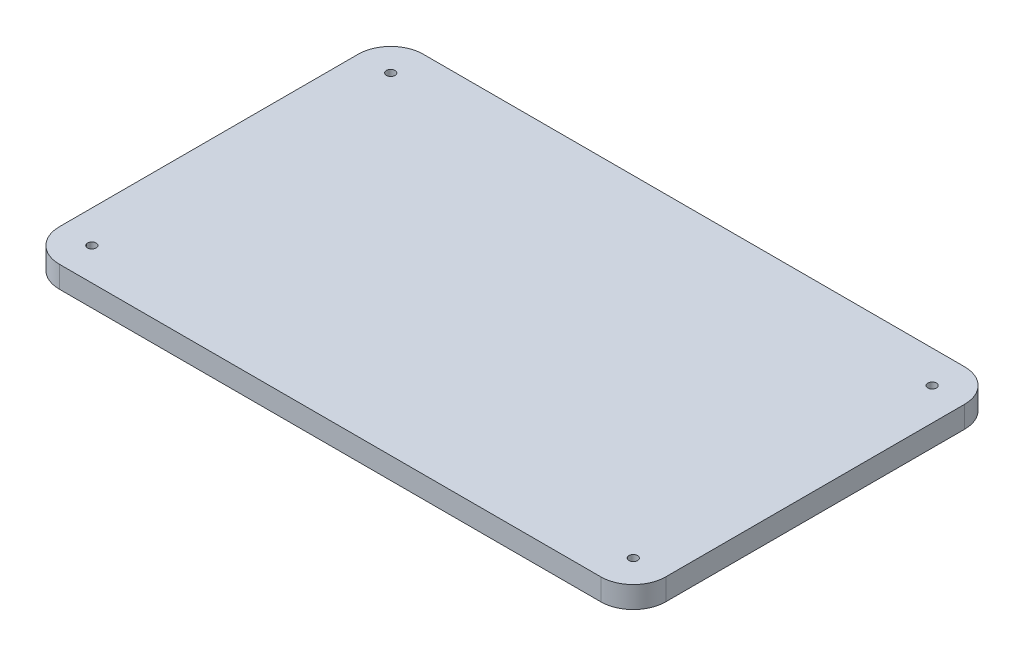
ISO-10303-21;
HEADER;
FILE_DESCRIPTION(('STEP AP214'),'2;1');
FILE_NAME('part.step','',(''),(''),'','','');
FILE_SCHEMA(('AUTOMOTIVE_DESIGN { 1 0 10303 214 1 1 1 1 }'));
ENDSEC;
DATA;
#1=APPLICATION_CONTEXT('core data for automotive mechanical design processes');
#2=APPLICATION_PROTOCOL_DEFINITION('international standard','automotive_design',2000,#1);
#3=PRODUCT_CONTEXT('',#1,'mechanical');
#4=PRODUCT('Part','Part','',(#3));
#5=PRODUCT_RELATED_PRODUCT_CATEGORY('part','',(#4));
#6=PRODUCT_DEFINITION_FORMATION('','',#4);
#7=PRODUCT_DEFINITION_CONTEXT('part definition',#1,'design');
#8=PRODUCT_DEFINITION('design','',#6,#7);
#9=PRODUCT_DEFINITION_SHAPE('','',#8);
#10=(LENGTH_UNIT() NAMED_UNIT(*) SI_UNIT(.MILLI.,.METRE.));
#11=(NAMED_UNIT(*) PLANE_ANGLE_UNIT() SI_UNIT($,.RADIAN.));
#12=(NAMED_UNIT(*) SI_UNIT($,.STERADIAN.) SOLID_ANGLE_UNIT());
#13=UNCERTAINTY_MEASURE_WITH_UNIT(LENGTH_MEASURE(1.E-05),#10,'distance_accuracy_value','');
#14=(GEOMETRIC_REPRESENTATION_CONTEXT(3) GLOBAL_UNCERTAINTY_ASSIGNED_CONTEXT((#13)) GLOBAL_UNIT_ASSIGNED_CONTEXT((#10,
#11,#12)) REPRESENTATION_CONTEXT('',''));
#15=CARTESIAN_POINT('',(0.,0.,0.));
#16=DIRECTION('',(0.,0.,1.));
#17=DIRECTION('',(1.,0.,0.));
#18=AXIS2_PLACEMENT_3D('',#15,#16,#17);
#19=CARTESIAN_POINT('',(79.375,6.35,-43.815));
#20=DIRECTION('',(0.,-1.,0.));
#21=DIRECTION('',(0.,0.,-1.));
#22=AXIS2_PLACEMENT_3D('',#19,#20,#21);
#23=CYLINDRICAL_SURFACE('',#22,9.52500000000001);
#24=CARTESIAN_POINT('',(79.375,0.,-43.815));
#25=DIRECTION('',(0.,1.,0.));
#26=DIRECTION('',(0.,0.,1.));
#27=AXIS2_PLACEMENT_3D('',#24,#25,#26);
#28=CIRCLE('',#27,9.52500000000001);
#29=CARTESIAN_POINT('',(88.9,0.,-43.815));
#30=VERTEX_POINT('',#29);
#31=CARTESIAN_POINT('',(79.375,0.,-53.34));
#32=VERTEX_POINT('',#31);
#33=EDGE_CURVE('E144',#30,#32,#28,.T.);
#34=ORIENTED_EDGE('',*,*,#33,.T.);
#35=DIRECTION('',(0.,-1.,0.));
#36=VECTOR('',#35,1.);
#37=CARTESIAN_POINT('',(79.375,6.35,-53.34));
#38=LINE('',#37,#36);
#39=CARTESIAN_POINT('',(79.375,6.35,-53.34));
#40=VERTEX_POINT('',#39);
#41=EDGE_CURVE('E11',#40,#32,#38,.T.);
#42=ORIENTED_EDGE('',*,*,#41,.F.);
#43=CARTESIAN_POINT('',(79.375,6.35,-43.815));
#44=DIRECTION('',(0.,1.,0.));
#45=DIRECTION('',(0.,0.,1.));
#46=AXIS2_PLACEMENT_3D('',#43,#44,#45);
#47=CIRCLE('',#46,9.52500000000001);
#48=CARTESIAN_POINT('',(88.9,6.35,-43.815));
#49=VERTEX_POINT('',#48);
#50=EDGE_CURVE('E167',#49,#40,#47,.T.);
#51=ORIENTED_EDGE('',*,*,#50,.F.);
#52=DIRECTION('',(0.,-1.,0.));
#53=VECTOR('',#52,1.);
#54=CARTESIAN_POINT('',(88.9,6.35,-43.815));
#55=LINE('',#54,#53);
#56=EDGE_CURVE('E140',#49,#30,#55,.T.);
#57=ORIENTED_EDGE('',*,*,#56,.T.);
#58=EDGE_LOOP('',(#34,#42,#51,#57));
#59=FACE_BOUND('',#58,.T.);
#60=ADVANCED_FACE('F41',(#59),#23,.T.);
#61=CARTESIAN_POINT('',(79.375,6.35,-53.34));
#62=DIRECTION('',(0.,0.,1.));
#63=DIRECTION('',(1.,0.,0.));
#64=AXIS2_PLACEMENT_3D('',#61,#62,#63);
#65=PLANE('',#64);
#66=DIRECTION('',(-1.,0.,0.));
#67=VECTOR('',#66,1.);
#68=CARTESIAN_POINT('',(79.375,0.,-53.34));
#69=LINE('',#68,#67);
#70=CARTESIAN_POINT('',(-79.375,0.,-53.34));
#71=VERTEX_POINT('',#70);
#72=EDGE_CURVE('E148',#32,#71,#69,.T.);
#73=ORIENTED_EDGE('',*,*,#72,.T.);
#74=DIRECTION('',(0.,-1.,0.));
#75=VECTOR('',#74,1.);
#76=CARTESIAN_POINT('',(-79.375,6.35,-53.34));
#77=LINE('',#76,#75);
#78=CARTESIAN_POINT('',(-79.375,6.35,-53.34));
#79=VERTEX_POINT('',#78);
#80=EDGE_CURVE('E51',#79,#71,#77,.T.);
#81=ORIENTED_EDGE('',*,*,#80,.F.);
#82=DIRECTION('',(-1.,0.,0.));
#83=VECTOR('',#82,1.);
#84=CARTESIAN_POINT('',(79.375,6.35,-53.34));
#85=LINE('',#84,#83);
#86=EDGE_CURVE('E103',#40,#79,#85,.T.);
#87=ORIENTED_EDGE('',*,*,#86,.F.);
#88=ORIENTED_EDGE('',*,*,#41,.T.);
#89=EDGE_LOOP('',(#73,#81,#87,#88));
#90=FACE_BOUND('',#89,.T.);
#91=ADVANCED_FACE('F248',(#90),#65,.F.);
#92=CARTESIAN_POINT('',(-79.375,6.35,-43.815));
#93=DIRECTION('',(0.,-1.,0.));
#94=DIRECTION('',(0.,0.,-1.));
#95=AXIS2_PLACEMENT_3D('',#92,#93,#94);
#96=CYLINDRICAL_SURFACE('',#95,9.52500000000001);
#97=CARTESIAN_POINT('',(-79.375,0.,-43.815));
#98=DIRECTION('',(0.,1.,0.));
#99=DIRECTION('',(0.,0.,1.));
#100=AXIS2_PLACEMENT_3D('',#97,#98,#99);
#101=CIRCLE('',#100,9.52500000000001);
#102=CARTESIAN_POINT('',(-88.9,0.,-43.815));
#103=VERTEX_POINT('',#102);
#104=EDGE_CURVE('E152',#71,#103,#101,.T.);
#105=ORIENTED_EDGE('',*,*,#104,.T.);
#106=DIRECTION('',(0.,-1.,0.));
#107=VECTOR('',#106,1.);
#108=CARTESIAN_POINT('',(-88.9,6.35,-43.815));
#109=LINE('',#108,#107);
#110=CARTESIAN_POINT('',(-88.9,6.35,-43.815));
#111=VERTEX_POINT('',#110);
#112=EDGE_CURVE('E178',#111,#103,#109,.T.);
#113=ORIENTED_EDGE('',*,*,#112,.F.);
#114=CARTESIAN_POINT('',(-79.375,6.35,-43.815));
#115=DIRECTION('',(0.,1.,0.));
#116=DIRECTION('',(0.,0.,1.));
#117=AXIS2_PLACEMENT_3D('',#114,#115,#116);
#118=CIRCLE('',#117,9.52500000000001);
#119=EDGE_CURVE('E213',#79,#111,#118,.T.);
#120=ORIENTED_EDGE('',*,*,#119,.F.);
#121=ORIENTED_EDGE('',*,*,#80,.T.);
#122=EDGE_LOOP('',(#105,#113,#120,#121));
#123=FACE_BOUND('',#122,.T.);
#124=ADVANCED_FACE('F252',(#123),#96,.T.);
#125=CARTESIAN_POINT('',(-88.9,6.35,-43.815));
#126=DIRECTION('',(1.,0.,0.));
#127=DIRECTION('',(0.,0.,-1.));
#128=AXIS2_PLACEMENT_3D('',#125,#126,#127);
#129=PLANE('',#128);
#130=DIRECTION('',(0.,0.,1.));
#131=VECTOR('',#130,1.);
#132=CARTESIAN_POINT('',(-88.9,0.,-43.815));
#133=LINE('',#132,#131);
#134=CARTESIAN_POINT('',(-88.9,0.,43.815));
#135=VERTEX_POINT('',#134);
#136=EDGE_CURVE('E155',#103,#135,#133,.T.);
#137=ORIENTED_EDGE('',*,*,#136,.T.);
#138=DIRECTION('',(0.,-1.,0.));
#139=VECTOR('',#138,1.);
#140=CARTESIAN_POINT('',(-88.9,6.35,43.815));
#141=LINE('',#140,#139);
#142=CARTESIAN_POINT('',(-88.9,6.35,43.815));
#143=VERTEX_POINT('',#142);
#144=EDGE_CURVE('E174',#143,#135,#141,.T.);
#145=ORIENTED_EDGE('',*,*,#144,.F.);
#146=DIRECTION('',(0.,0.,1.));
#147=VECTOR('',#146,1.);
#148=CARTESIAN_POINT('',(-88.9,6.35,-43.815));
#149=LINE('',#148,#147);
#150=EDGE_CURVE('E216',#111,#143,#149,.T.);
#151=ORIENTED_EDGE('',*,*,#150,.F.);
#152=ORIENTED_EDGE('',*,*,#112,.T.);
#153=EDGE_LOOP('',(#137,#145,#151,#152));
#154=FACE_BOUND('',#153,.T.);
#155=ADVANCED_FACE('F224',(#154),#129,.F.);
#156=CARTESIAN_POINT('',(-79.375,6.35,43.815));
#157=DIRECTION('',(0.,-1.,0.));
#158=DIRECTION('',(0.,0.,-1.));
#159=AXIS2_PLACEMENT_3D('',#156,#157,#158);
#160=CYLINDRICAL_SURFACE('',#159,9.525);
#161=CARTESIAN_POINT('',(-79.375,0.,43.815));
#162=DIRECTION('',(0.,1.,0.));
#163=DIRECTION('',(0.,0.,1.));
#164=AXIS2_PLACEMENT_3D('',#161,#162,#163);
#165=CIRCLE('',#164,9.525);
#166=CARTESIAN_POINT('',(-79.375,0.,53.34));
#167=VERTEX_POINT('',#166);
#168=EDGE_CURVE('E158',#135,#167,#165,.T.);
#169=ORIENTED_EDGE('',*,*,#168,.T.);
#170=DIRECTION('',(0.,-1.,0.));
#171=VECTOR('',#170,1.);
#172=CARTESIAN_POINT('',(-79.375,6.35,53.34));
#173=LINE('',#172,#171);
#174=CARTESIAN_POINT('',(-79.375,6.35,53.34));
#175=VERTEX_POINT('',#174);
#176=EDGE_CURVE('E133',#175,#167,#173,.T.);
#177=ORIENTED_EDGE('',*,*,#176,.F.);
#178=CARTESIAN_POINT('',(-79.375,6.35,43.815));
#179=DIRECTION('',(0.,1.,0.));
#180=DIRECTION('',(0.,0.,1.));
#181=AXIS2_PLACEMENT_3D('',#178,#179,#180);
#182=CIRCLE('',#181,9.525);
#183=EDGE_CURVE('E122',#143,#175,#182,.T.);
#184=ORIENTED_EDGE('',*,*,#183,.F.);
#185=ORIENTED_EDGE('',*,*,#144,.T.);
#186=EDGE_LOOP('',(#169,#177,#184,#185));
#187=FACE_BOUND('',#186,.T.);
#188=ADVANCED_FACE('F228',(#187),#160,.T.);
#189=CARTESIAN_POINT('',(-79.375,6.35,53.34));
#190=DIRECTION('',(0.,0.,-1.));
#191=DIRECTION('',(-1.,0.,0.));
#192=AXIS2_PLACEMENT_3D('',#189,#190,#191);
#193=PLANE('',#192);
#194=DIRECTION('',(1.,0.,0.));
#195=VECTOR('',#194,1.);
#196=CARTESIAN_POINT('',(-79.375,0.,53.34));
#197=LINE('',#196,#195);
#198=CARTESIAN_POINT('',(79.375,0.,53.34));
#199=VERTEX_POINT('',#198);
#200=EDGE_CURVE('E131',#167,#199,#197,.T.);
#201=ORIENTED_EDGE('',*,*,#200,.T.);
#202=DIRECTION('',(0.,-1.,0.));
#203=VECTOR('',#202,1.);
#204=CARTESIAN_POINT('',(79.375,6.35,53.34));
#205=LINE('',#204,#203);
#206=CARTESIAN_POINT('',(79.375,6.35,53.34));
#207=VERTEX_POINT('',#206);
#208=EDGE_CURVE('E128',#207,#199,#205,.T.);
#209=ORIENTED_EDGE('',*,*,#208,.F.);
#210=DIRECTION('',(1.,0.,0.));
#211=VECTOR('',#210,1.);
#212=CARTESIAN_POINT('',(-79.375,6.35,53.34));
#213=LINE('',#212,#211);
#214=EDGE_CURVE('E116',#175,#207,#213,.T.);
#215=ORIENTED_EDGE('',*,*,#214,.F.);
#216=ORIENTED_EDGE('',*,*,#176,.T.);
#217=EDGE_LOOP('',(#201,#209,#215,#216));
#218=FACE_BOUND('',#217,.T.);
#219=ADVANCED_FACE('F129',(#218),#193,.F.);
#220=CARTESIAN_POINT('',(79.375,6.35,43.815));
#221=DIRECTION('',(0.,-1.,0.));
#222=DIRECTION('',(0.,0.,-1.));
#223=AXIS2_PLACEMENT_3D('',#220,#221,#222);
#224=CYLINDRICAL_SURFACE('',#223,9.525);
#225=CARTESIAN_POINT('',(79.375,0.,43.815));
#226=DIRECTION('',(0.,1.,0.));
#227=DIRECTION('',(0.,0.,1.));
#228=AXIS2_PLACEMENT_3D('',#225,#226,#227);
#229=CIRCLE('',#228,9.525);
#230=CARTESIAN_POINT('',(88.9,0.,43.815));
#231=VERTEX_POINT('',#230);
#232=EDGE_CURVE('E89',#199,#231,#229,.T.);
#233=ORIENTED_EDGE('',*,*,#232,.T.);
#234=DIRECTION('',(0.,-1.,0.));
#235=VECTOR('',#234,1.);
#236=CARTESIAN_POINT('',(88.9,6.35,43.815));
#237=LINE('',#236,#235);
#238=CARTESIAN_POINT('',(88.9,6.35,43.815));
#239=VERTEX_POINT('',#238);
#240=EDGE_CURVE('E134',#239,#231,#237,.T.);
#241=ORIENTED_EDGE('',*,*,#240,.F.);
#242=CARTESIAN_POINT('',(79.375,6.35,43.815));
#243=DIRECTION('',(0.,1.,0.));
#244=DIRECTION('',(0.,0.,1.));
#245=AXIS2_PLACEMENT_3D('',#242,#243,#244);
#246=CIRCLE('',#245,9.525);
#247=EDGE_CURVE('E120',#207,#239,#246,.T.);
#248=ORIENTED_EDGE('',*,*,#247,.F.);
#249=ORIENTED_EDGE('',*,*,#208,.T.);
#250=EDGE_LOOP('',(#233,#241,#248,#249));
#251=FACE_BOUND('',#250,.T.);
#252=ADVANCED_FACE('F136',(#251),#224,.T.);
#253=CARTESIAN_POINT('',(88.9,6.35,43.815));
#254=DIRECTION('',(-1.,0.,0.));
#255=DIRECTION('',(0.,0.,1.));
#256=AXIS2_PLACEMENT_3D('',#253,#254,#255);
#257=PLANE('',#256);
#258=DIRECTION('',(0.,0.,-1.));
#259=VECTOR('',#258,1.);
#260=CARTESIAN_POINT('',(88.9,0.,43.815));
#261=LINE('',#260,#259);
#262=EDGE_CURVE('E95',#231,#30,#261,.T.);
#263=ORIENTED_EDGE('',*,*,#262,.T.);
#264=ORIENTED_EDGE('',*,*,#56,.F.);
#265=DIRECTION('',(0.,0.,-1.));
#266=VECTOR('',#265,1.);
#267=CARTESIAN_POINT('',(88.9,6.35,43.815));
#268=LINE('',#267,#266);
#269=EDGE_CURVE('E60',#239,#49,#268,.T.);
#270=ORIENTED_EDGE('',*,*,#269,.F.);
#271=ORIENTED_EDGE('',*,*,#240,.T.);
#272=EDGE_LOOP('',(#263,#264,#270,#271));
#273=FACE_BOUND('',#272,.T.);
#274=ADVANCED_FACE('F236',(#273),#257,.F.);
#275=CARTESIAN_POINT('',(79.375,6.35,-43.815));
#276=DIRECTION('',(0.,1.,0.));
#277=DIRECTION('',(0.,0.,1.));
#278=AXIS2_PLACEMENT_3D('',#275,#276,#277);
#279=PLANE('',#278);
#280=CARTESIAN_POINT('',(79.375,6.35,-43.815));
#281=DIRECTION('',(0.,1.,0.));
#282=DIRECTION('',(0.,0.,1.));
#283=AXIS2_PLACEMENT_3D('',#280,#281,#282);
#284=CIRCLE('',#283,1.26999999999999);
#285=CARTESIAN_POINT('',(79.375,6.35,-42.545));
#286=VERTEX_POINT('',#285);
#287=EDGE_CURVE('E344',#286,#286,#284,.T.);
#288=ORIENTED_EDGE('',*,*,#287,.F.);
#289=EDGE_LOOP('',(#288));
#290=FACE_BOUND('',#289,.T.);
#291=CARTESIAN_POINT('',(79.375,6.35,43.815));
#292=DIRECTION('',(0.,1.,0.));
#293=DIRECTION('',(0.,0.,1.));
#294=AXIS2_PLACEMENT_3D('',#291,#292,#293);
#295=CIRCLE('',#294,1.26999999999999);
#296=CARTESIAN_POINT('',(79.375,6.35,45.085));
#297=VERTEX_POINT('',#296);
#298=EDGE_CURVE('E202',#297,#297,#295,.T.);
#299=ORIENTED_EDGE('',*,*,#298,.F.);
#300=EDGE_LOOP('',(#299));
#301=FACE_BOUND('',#300,.T.);
#302=CARTESIAN_POINT('',(-79.375,6.35,-43.815));
#303=DIRECTION('',(0.,1.,0.));
#304=DIRECTION('',(0.,0.,1.));
#305=AXIS2_PLACEMENT_3D('',#302,#303,#304);
#306=CIRCLE('',#305,1.26999999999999);
#307=CARTESIAN_POINT('',(-79.375,6.35,-42.545));
#308=VERTEX_POINT('',#307);
#309=EDGE_CURVE('E188',#308,#308,#306,.T.);
#310=ORIENTED_EDGE('',*,*,#309,.F.);
#311=EDGE_LOOP('',(#310));
#312=FACE_BOUND('',#311,.T.);
#313=CARTESIAN_POINT('',(-79.375,6.35,43.815));
#314=DIRECTION('',(0.,1.,0.));
#315=DIRECTION('',(0.,0.,1.));
#316=AXIS2_PLACEMENT_3D('',#313,#314,#315);
#317=CIRCLE('',#316,1.26999999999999);
#318=CARTESIAN_POINT('',(-79.375,6.35,45.085));
#319=VERTEX_POINT('',#318);
#320=EDGE_CURVE('E187',#319,#319,#317,.T.);
#321=ORIENTED_EDGE('',*,*,#320,.F.);
#322=EDGE_LOOP('',(#321));
#323=FACE_BOUND('',#322,.T.);
#324=ORIENTED_EDGE('',*,*,#50,.T.);
#325=ORIENTED_EDGE('',*,*,#86,.T.);
#326=ORIENTED_EDGE('',*,*,#119,.T.);
#327=ORIENTED_EDGE('',*,*,#150,.T.);
#328=ORIENTED_EDGE('',*,*,#183,.T.);
#329=ORIENTED_EDGE('',*,*,#214,.T.);
#330=ORIENTED_EDGE('',*,*,#247,.T.);
#331=ORIENTED_EDGE('',*,*,#269,.T.);
#332=EDGE_LOOP('',(#324,#325,#326,#327,#328,#329,#330,#331));
#333=FACE_BOUND('',#332,.T.);
#334=ADVANCED_FACE('F118',(#290,#301,#312,#323,#333),#279,.T.);
#335=CARTESIAN_POINT('',(79.375,0.,-43.815));
#336=DIRECTION('',(0.,1.,0.));
#337=DIRECTION('',(0.,0.,1.));
#338=AXIS2_PLACEMENT_3D('',#335,#336,#337);
#339=PLANE('',#338);
#340=CARTESIAN_POINT('',(79.375,0.,-43.815));
#341=DIRECTION('',(0.,1.,0.));
#342=DIRECTION('',(0.,0.,1.));
#343=AXIS2_PLACEMENT_3D('',#340,#341,#342);
#344=CIRCLE('',#343,1.26999999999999);
#345=CARTESIAN_POINT('',(79.375,0.,-42.545));
#346=VERTEX_POINT('',#345);
#347=EDGE_CURVE('E44',#346,#346,#344,.T.);
#348=ORIENTED_EDGE('',*,*,#347,.T.);
#349=EDGE_LOOP('',(#348));
#350=FACE_BOUND('',#349,.T.);
#351=CARTESIAN_POINT('',(79.375,0.,43.815));
#352=DIRECTION('',(0.,1.,0.));
#353=DIRECTION('',(0.,0.,1.));
#354=AXIS2_PLACEMENT_3D('',#351,#352,#353);
#355=CIRCLE('',#354,1.26999999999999);
#356=CARTESIAN_POINT('',(79.375,0.,45.085));
#357=VERTEX_POINT('',#356);
#358=EDGE_CURVE('E196',#357,#357,#355,.T.);
#359=ORIENTED_EDGE('',*,*,#358,.T.);
#360=EDGE_LOOP('',(#359));
#361=FACE_BOUND('',#360,.T.);
#362=CARTESIAN_POINT('',(-79.375,0.,-43.815));
#363=DIRECTION('',(0.,1.,0.));
#364=DIRECTION('',(0.,0.,1.));
#365=AXIS2_PLACEMENT_3D('',#362,#363,#364);
#366=CIRCLE('',#365,1.26999999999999);
#367=CARTESIAN_POINT('',(-79.375,0.,-42.545));
#368=VERTEX_POINT('',#367);
#369=EDGE_CURVE('E184',#368,#368,#366,.T.);
#370=ORIENTED_EDGE('',*,*,#369,.T.);
#371=EDGE_LOOP('',(#370));
#372=FACE_BOUND('',#371,.T.);
#373=CARTESIAN_POINT('',(-79.375,0.,43.815));
#374=DIRECTION('',(0.,1.,0.));
#375=DIRECTION('',(0.,0.,1.));
#376=AXIS2_PLACEMENT_3D('',#373,#374,#375);
#377=CIRCLE('',#376,1.26999999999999);
#378=CARTESIAN_POINT('',(-79.375,0.,45.085));
#379=VERTEX_POINT('',#378);
#380=EDGE_CURVE('E149',#379,#379,#377,.T.);
#381=ORIENTED_EDGE('',*,*,#380,.T.);
#382=EDGE_LOOP('',(#381));
#383=FACE_BOUND('',#382,.T.);
#384=ORIENTED_EDGE('',*,*,#33,.F.);
#385=ORIENTED_EDGE('',*,*,#262,.F.);
#386=ORIENTED_EDGE('',*,*,#232,.F.);
#387=ORIENTED_EDGE('',*,*,#200,.F.);
#388=ORIENTED_EDGE('',*,*,#168,.F.);
#389=ORIENTED_EDGE('',*,*,#136,.F.);
#390=ORIENTED_EDGE('',*,*,#104,.F.);
#391=ORIENTED_EDGE('',*,*,#72,.F.);
#392=EDGE_LOOP('',(#384,#385,#386,#387,#388,#389,#390,#391));
#393=FACE_BOUND('',#392,.T.);
#394=ADVANCED_FACE('F231',(#350,#361,#372,#383,#393),#339,.F.);
#395=CARTESIAN_POINT('',(-79.375,6.35,43.815));
#396=DIRECTION('',(0.,1.,0.));
#397=DIRECTION('',(0.,0.,1.));
#398=AXIS2_PLACEMENT_3D('',#395,#396,#397);
#399=CYLINDRICAL_SURFACE('',#398,1.26999999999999);
#400=ORIENTED_EDGE('',*,*,#320,.T.);
#401=EDGE_LOOP('',(#400));
#402=FACE_BOUND('',#401,.T.);
#403=ORIENTED_EDGE('',*,*,#380,.F.);
#404=EDGE_LOOP('',(#403));
#405=FACE_BOUND('',#404,.T.);
#406=ADVANCED_FACE('F291',(#402,#405),#399,.F.);
#407=CARTESIAN_POINT('',(-79.375,6.35,-43.815));
#408=DIRECTION('',(0.,1.,0.));
#409=DIRECTION('',(0.,0.,1.));
#410=AXIS2_PLACEMENT_3D('',#407,#408,#409);
#411=CYLINDRICAL_SURFACE('',#410,1.26999999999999);
#412=ORIENTED_EDGE('',*,*,#309,.T.);
#413=EDGE_LOOP('',(#412));
#414=FACE_BOUND('',#413,.T.);
#415=ORIENTED_EDGE('',*,*,#369,.F.);
#416=EDGE_LOOP('',(#415));
#417=FACE_BOUND('',#416,.T.);
#418=ADVANCED_FACE('F301',(#414,#417),#411,.F.);
#419=CARTESIAN_POINT('',(79.375,6.35,43.815));
#420=DIRECTION('',(0.,1.,0.));
#421=DIRECTION('',(0.,0.,1.));
#422=AXIS2_PLACEMENT_3D('',#419,#420,#421);
#423=CYLINDRICAL_SURFACE('',#422,1.26999999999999);
#424=ORIENTED_EDGE('',*,*,#298,.T.);
#425=EDGE_LOOP('',(#424));
#426=FACE_BOUND('',#425,.T.);
#427=ORIENTED_EDGE('',*,*,#358,.F.);
#428=EDGE_LOOP('',(#427));
#429=FACE_BOUND('',#428,.T.);
#430=ADVANCED_FACE('F312',(#426,#429),#423,.F.);
#431=CARTESIAN_POINT('',(79.375,6.35,-43.815));
#432=DIRECTION('',(0.,1.,0.));
#433=DIRECTION('',(0.,0.,1.));
#434=AXIS2_PLACEMENT_3D('',#431,#432,#433);
#435=CYLINDRICAL_SURFACE('',#434,1.26999999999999);
#436=ORIENTED_EDGE('',*,*,#287,.T.);
#437=EDGE_LOOP('',(#436));
#438=FACE_BOUND('',#437,.T.);
#439=ORIENTED_EDGE('',*,*,#347,.F.);
#440=EDGE_LOOP('',(#439));
#441=FACE_BOUND('',#440,.T.);
#442=ADVANCED_FACE('F322',(#438,#441),#435,.F.);
#443=CLOSED_SHELL('',(#60,#91,#124,#155,#188,#219,#252,#274,#334,#394,#406,#418,#430,#442));
#444=MANIFOLD_SOLID_BREP('B2',#443);
#445=ADVANCED_BREP_SHAPE_REPRESENTATION('',(#18,#444),#14);
#446=SHAPE_DEFINITION_REPRESENTATION(#9,#445);
ENDSEC;
END-ISO-10303-21;
